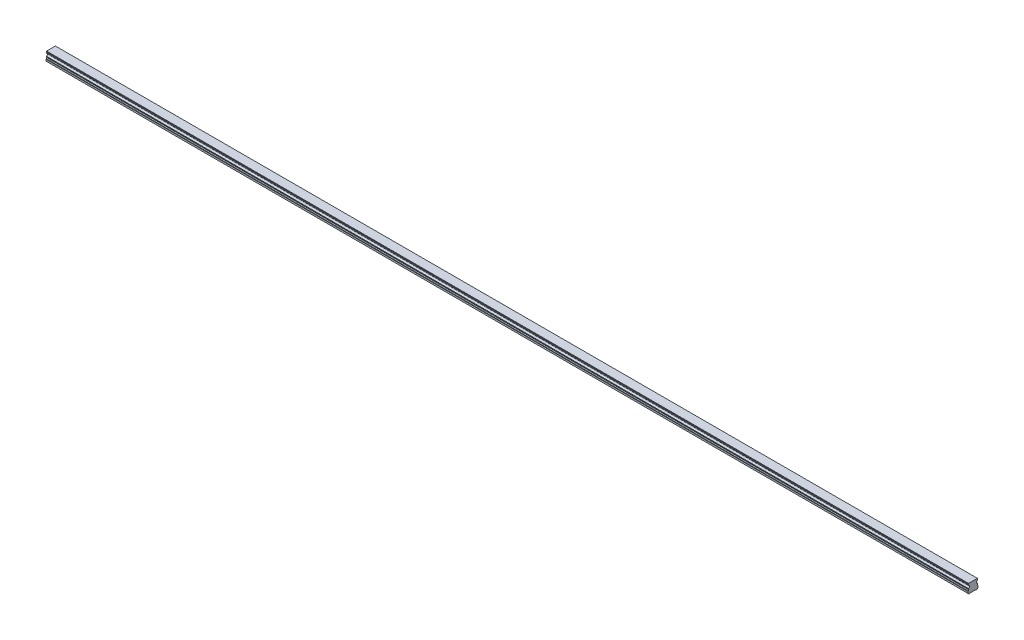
from build123d import *

# Parameters (mm, degrees)
BOSS_EXTRUDE1_DEPTH        = 1380
SKETCH3_R                  = 2.5
SKETCH3_R_2                = 2.1
CUT_EXTRUDE3_DEPTH         = 7
SKETCH3_2_R                = 2.1
CUT_EXTRUDE4_DEPTH         = 9.5
CHAMFER1_SIZE              = 0.4
LPATTERN2_COUNT            = 23
LPATTERN2_PITCH            = 60
CHAMFER1_OF_LPATTERN2_SIZE = 0.4


with BuildPart() as part:
    # Sketch1 → Boss-Extrude1 (new body)
    with BuildSketch(Plane(origin=(0, 0, 0), x_dir=(0, 0, -1), z_dir=(1, 0, 0))):
        with BuildLine():
            Line((6.59, 14), (-6.59, 14))
            Line((-6.59, 14), (-6.59, 13.15))
            Line((-6.59, 13.15), (-6.96, 12.356532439))
            Line((-6.96, 12.356532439), (-6.96, 11.435174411))
            ThreePointArc((-6.96, 11.435174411), (-5.25, 9.5), (-6.96, 7.564825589))
            Line((-6.96, 7.564825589), (-6.96, 6.643467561))
            Line((-6.96, 6.643467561), (-6.59, 5.85))
            Line((-6.59, 5.85), (-7.032116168, 4.2))
            Line((-7.032116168, 4.2), (-7.5, 3.929867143))
            Line((-7.5, 3.929867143), (-7.5, 1.4))
            Line((-7.5, 1.4), (-6.1, 0))
            Line((-6.1, 0), (-3.65, 0))
            Line((-3.65, 0), (-3.25, 0.4))
            Line((-3.25, 0.4), (3.25, 0.4))
            Line((3.25, 0.4), (3.65, 0))
            Line((3.65, 0), (6.1, 0))
            Line((6.1, 0), (7.5, 1.4))
            Line((7.5, 1.4), (7.5, 3.929867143))
            Line((7.5, 3.929867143), (7.032116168, 4.2))
            Line((7.032116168, 4.2), (6.59, 5.85))
            Line((6.59, 5.85), (6.96, 6.643467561))
            Line((6.96, 6.643467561), (6.96, 7.564825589))
            ThreePointArc((6.96, 7.564825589), (5.25, 9.5), (6.96, 11.435174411))
            Line((6.96, 11.435174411), (6.96, 12.356532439))
            Line((6.96, 12.356532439), (6.59, 13.15))
            Line((6.59, 13.15), (6.59, 14))
        make_face()
    extrude(amount=BOSS_EXTRUDE1_DEPTH)

    # Sketch3 → Cut-Extrude3 (cut)
    with BuildSketch(Plane.XZ):
        with Locations(Location((30, 0, 0), (0, 0, 270))):
            Circle(SKETCH3_R)
        with Locations(Location((30, 0, 0), (0, 0, 270))):
            Circle(SKETCH3_R_2, mode=Mode.SUBTRACT)
    cut_extrude3 = extrude(amount=-CUT_EXTRUDE3_DEPTH, mode=Mode.SUBTRACT)

    # Sketch3_2 → Cut-Extrude4 (cut)
    with BuildSketch(Plane.XZ):
        with Locations(Location((30, 0, 0), (0, 0, 270))):
            Circle(SKETCH3_2_R)
    cut_extrude4 = extrude(amount=-CUT_EXTRUDE4_DEPTH, mode=Mode.SUBTRACT)

    # Cut-Extrude5 cone 1 section (on through the dimple's axis) → Cut-Extrude5 (revolve, cut)
    with BuildSketch(Plane(origin=(30, 9.5, 0), x_dir=(0, 0, -1), z_dir=(1, 0, 0))):
        Polygon((0, 0), (2.1, 0), (0, 1.212435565), align=None)
    revolve(axis=Axis((30, 9.5, 0), (0, 1, 0)), mode=Mode.SUBTRACT)

    # Chamfer1
    chamfer1_edges = [part.edges().sort_by_distance(p)[0] for p in [
        (30, 0.4, 2.5),
    ]]
    chamfer(chamfer1_edges, length=CHAMFER1_SIZE)

    # LPattern2: Cut-Extrude3, Cut-Extrude4 ×23
    with Locations(*[(i * LPATTERN2_PITCH, 0, 0) for i in range(1, LPATTERN2_COUNT)]):
        add(cut_extrude3, mode=Mode.SUBTRACT)
        add(cut_extrude4, mode=Mode.SUBTRACT)

    # Chamfer1 of LPattern2
    chamfer1_of_lpattern2_edges = [part.edges().sort_by_distance(p)[0] for p in [
        (90, 0.4, 2.5),
        (150, 0.4, 2.5),
        (210, 0.4, 2.5),
        (270, 0.4, 2.5),
        (330, 0.4, 2.5),
        (390, 0.4, 2.5),
        (450, 0.4, 2.5),
        (510, 0.4, 2.5),
        (570, 0.4, 2.5),
        (630, 0.4, 2.5),
        (690, 0.4, 2.5),
        (750, 0.4, 2.5),
        (810, 0.4, 2.5),
        (870, 0.4, 2.5),
        (930, 0.4, 2.5),
        (990, 0.4, 2.5),
        (1050, 0.4, 2.5),
        (1110, 0.4, 2.5),
        (1170, 0.4, 2.5),
        (1230, 0.4, 2.5),
        (1290, 0.4, 2.5),
        (1350, 0.4, 2.5),
    ]]
    chamfer(chamfer1_of_lpattern2_edges, length=CHAMFER1_OF_LPATTERN2_SIZE)


solid = part.part
